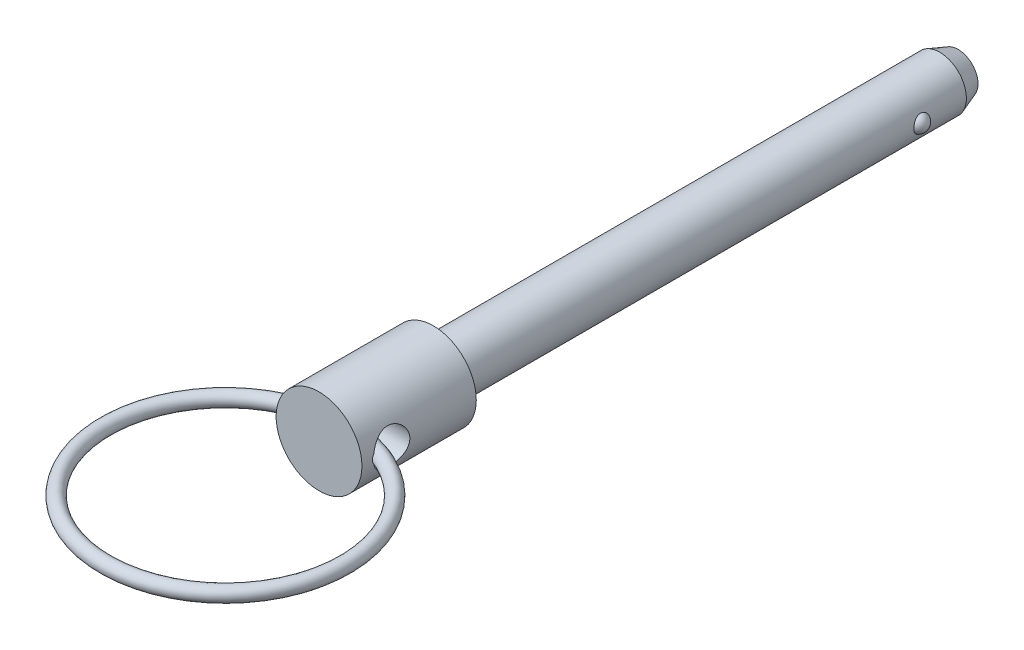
ISO-10303-21;
HEADER;
FILE_DESCRIPTION(('STEP AP214'),'2;1');
FILE_NAME('part.step','',(''),(''),'','','');
FILE_SCHEMA(('AUTOMOTIVE_DESIGN { 1 0 10303 214 1 1 1 1 }'));
ENDSEC;
DATA;
#1=APPLICATION_CONTEXT('core data for automotive mechanical design processes');
#2=APPLICATION_PROTOCOL_DEFINITION('international standard','automotive_design',2000,#1);
#3=PRODUCT_CONTEXT('',#1,'mechanical');
#4=PRODUCT('Part','Part','',(#3));
#5=PRODUCT_RELATED_PRODUCT_CATEGORY('part','',(#4));
#6=PRODUCT_DEFINITION_FORMATION('','',#4);
#7=PRODUCT_DEFINITION_CONTEXT('part definition',#1,'design');
#8=PRODUCT_DEFINITION('design','',#6,#7);
#9=PRODUCT_DEFINITION_SHAPE('','',#8);
#10=(LENGTH_UNIT() NAMED_UNIT(*) SI_UNIT(.MILLI.,.METRE.));
#11=(NAMED_UNIT(*) PLANE_ANGLE_UNIT() SI_UNIT($,.RADIAN.));
#12=(NAMED_UNIT(*) SI_UNIT($,.STERADIAN.) SOLID_ANGLE_UNIT());
#13=UNCERTAINTY_MEASURE_WITH_UNIT(LENGTH_MEASURE(1.E-05),#10,'distance_accuracy_value','');
#14=(GEOMETRIC_REPRESENTATION_CONTEXT(3) GLOBAL_UNCERTAINTY_ASSIGNED_CONTEXT((#13)) GLOBAL_UNIT_ASSIGNED_CONTEXT((#10,
#11,#12)) REPRESENTATION_CONTEXT('',''));
#15=CARTESIAN_POINT('',(0.,0.,0.));
#16=DIRECTION('',(0.,0.,1.));
#17=DIRECTION('',(1.,0.,0.));
#18=AXIS2_PLACEMENT_3D('',#15,#16,#17);
#19=CARTESIAN_POINT('',(6.35,0.,9.398));
#20=DIRECTION('',(-1.,0.,0.));
#21=DIRECTION('',(0.,0.,-1.));
#22=AXIS2_PLACEMENT_3D('',#19,#20,#21);
#23=CYLINDRICAL_SURFACE('',#22,2.0193);
#24=CARTESIAN_POINT('',(-4.76270000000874,0.498153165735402,11.3548893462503));
#25=CARTESIAN_POINT('',(-4.72833190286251,0.475048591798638,11.3607446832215));
#26=CARTESIAN_POINT('',(-4.69505034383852,0.449919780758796,11.3667299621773));
#27=CARTESIAN_POINT('',(-4.63192457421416,0.394832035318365,11.3785339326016));
#28=CARTESIAN_POINT('',(-4.60213511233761,0.364810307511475,11.3843491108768));
#29=CARTESIAN_POINT('',(-4.55535458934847,0.308281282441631,11.393775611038));
#30=CARTESIAN_POINT('',(-4.53705372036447,0.282907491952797,11.3975656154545));
#31=CARTESIAN_POINT('',(-4.50470768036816,0.229597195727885,11.4043835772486));
#32=CARTESIAN_POINT('',(-4.49064226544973,0.201673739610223,11.4074151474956));
#33=CARTESIAN_POINT('',(-4.46975490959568,0.148629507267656,11.4119668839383));
#34=CARTESIAN_POINT('',(-4.46210314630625,0.12385291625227,11.413657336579));
#35=CARTESIAN_POINT('',(-4.45097170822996,0.0733134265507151,11.4161269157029));
#36=CARTESIAN_POINT('',(-4.4474922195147,0.0475504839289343,11.4169060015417));
#37=CARTESIAN_POINT('',(-4.44500621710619,-0.00425946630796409,11.4174619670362));
#38=CARTESIAN_POINT('',(-4.44600914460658,-0.0303069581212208,11.4172367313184));
#39=CARTESIAN_POINT('',(-4.45241947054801,-0.081820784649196,11.4158064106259));
#40=CARTESIAN_POINT('',(-4.45782777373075,-0.107286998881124,11.414601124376));
#41=CARTESIAN_POINT('',(-4.47240849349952,-0.1562944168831,11.4113883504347));
#42=CARTESIAN_POINT('',(-4.48147591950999,-0.179868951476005,11.4094032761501));
#43=CARTESIAN_POINT('',(-4.50279050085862,-0.225454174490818,11.404805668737));
#44=CARTESIAN_POINT('',(-4.51503925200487,-0.247464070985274,11.4021928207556));
#45=CARTESIAN_POINT('',(-4.55011891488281,-0.302206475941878,11.394845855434));
#46=CARTESIAN_POINT('',(-4.57493397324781,-0.333621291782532,11.3897686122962));
#47=CARTESIAN_POINT('',(-4.62912866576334,-0.392111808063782,11.3790894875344));
#48=CARTESIAN_POINT('',(-4.65852008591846,-0.419175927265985,11.3734862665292));
#49=CARTESIAN_POINT('',(-4.71307862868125,-0.463335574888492,11.3635175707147));
#50=CARTESIAN_POINT('',(-4.73757440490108,-0.481267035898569,11.3591766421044));
#51=CARTESIAN_POINT('',(-4.76270000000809,-0.498153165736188,11.3548893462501));
#52=B_SPLINE_CURVE_WITH_KNOTS('',3,(#24,#25,#26,#27,#28,#29,#30,#31,#32,#33,#34,#35,#36,#37,#38,
#39,#40,#41,#42,#43,#44,#45,#46,#47,#48,#49,#50,#51),.UNSPECIFIED.,.F.,.F.,(4,2,2,2,2,2,2,2,2,2,
2,2,2,4),(0.,0.125801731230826,0.253367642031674,0.347579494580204,0.441333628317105,
0.518959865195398,0.596589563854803,0.674382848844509,0.752192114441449,0.827911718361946,
0.903669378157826,1.02403641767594,1.14471874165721,1.2365323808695),.UNSPECIFIED.);
#53=CARTESIAN_POINT('',(-4.73813099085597,0.481166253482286,11.3591352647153));
#54=VERTEX_POINT('',#53);
#55=CARTESIAN_POINT('',(-4.73813099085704,-0.481166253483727,11.359135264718));
#56=VERTEX_POINT('',#55);
#57=EDGE_CURVE('E40',#54,#56,#52,.T.);
#58=ORIENTED_EDGE('',*,*,#57,.F.);
#59=CARTESIAN_POINT('',(-4.7625,0.,11.4173));
#60=CARTESIAN_POINT('',(-4.76249489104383,-0.108112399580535,11.4172937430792));
#61=CARTESIAN_POINT('',(-4.75878025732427,-0.216312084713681,11.408574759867));
#62=CARTESIAN_POINT('',(-4.74429807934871,-0.429541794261,11.3740482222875));
#63=CARTESIAN_POINT('',(-4.73352107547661,-0.534567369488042,11.3482177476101));
#64=CARTESIAN_POINT('',(-4.70606638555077,-0.738151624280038,11.2805979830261));
#65=CARTESIAN_POINT('',(-4.68940628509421,-0.836728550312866,11.2388562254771));
#66=CARTESIAN_POINT('',(-4.65179514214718,-1.02541561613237,11.1408163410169));
#67=CARTESIAN_POINT('',(-4.63084399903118,-1.11552555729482,11.0845178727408));
#68=CARTESIAN_POINT('',(-4.58553515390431,-1.28946876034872,10.9559107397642));
#69=CARTESIAN_POINT('',(-4.56106355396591,-1.37280723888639,10.8829734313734));
#70=CARTESIAN_POINT('',(-4.51195602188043,-1.52649281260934,10.7244940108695));
#71=CARTESIAN_POINT('',(-4.48732001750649,-1.5968337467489,10.6389459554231));
#72=CARTESIAN_POINT('',(-4.43925108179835,-1.7261116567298,10.452343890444));
#73=CARTESIAN_POINT('',(-4.415945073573,-1.78427664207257,10.3507188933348));
#74=CARTESIAN_POINT('',(-4.3749946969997,-1.88246618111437,10.1379969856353));
#75=CARTESIAN_POINT('',(-4.35734737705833,-1.92250019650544,10.026905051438));
#76=CARTESIAN_POINT('',(-4.33095312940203,-1.98122376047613,9.80411364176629));
#77=CARTESIAN_POINT('',(-4.32180970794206,-2.0008697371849,9.69271508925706));
#78=CARTESIAN_POINT('',(-4.31232297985,-2.02124136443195,9.46785625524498));
#79=CARTESIAN_POINT('',(-4.31197457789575,-2.02197796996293,9.35439720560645));
#80=CARTESIAN_POINT('',(-4.31978298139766,-2.00522830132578,9.13832342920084));
#81=CARTESIAN_POINT('',(-4.32726229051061,-1.98919366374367,9.03556669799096));
#82=CARTESIAN_POINT('',(-4.34873498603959,-1.94179810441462,8.83436976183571));
#83=CARTESIAN_POINT('',(-4.36272967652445,-1.91043411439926,8.73593042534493));
#84=CARTESIAN_POINT('',(-4.39597564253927,-1.83265370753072,8.54363008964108));
#85=CARTESIAN_POINT('',(-4.41533413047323,-1.78592620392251,8.44991428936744));
#86=CARTESIAN_POINT('',(-4.45710273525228,-1.67896759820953,8.27128429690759));
#87=CARTESIAN_POINT('',(-4.47951396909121,-1.61873154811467,8.1863733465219));
#88=CARTESIAN_POINT('',(-4.52725353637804,-1.48026834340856,8.0199216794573));
#89=CARTESIAN_POINT('',(-4.55266534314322,-1.40092677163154,7.93932933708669));
#90=CARTESIAN_POINT('',(-4.6018976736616,-1.22958667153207,7.79224755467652));
#91=CARTESIAN_POINT('',(-4.62571737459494,-1.13758167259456,7.72576536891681));
#92=CARTESIAN_POINT('',(-4.66982369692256,-0.940529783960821,7.60732387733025));
#93=CARTESIAN_POINT('',(-4.69000583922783,-0.835212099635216,7.55577397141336));
#94=CARTESIAN_POINT('',(-4.72372878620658,-0.616416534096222,7.47153070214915));
#95=CARTESIAN_POINT('',(-4.7372827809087,-0.502955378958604,7.43879986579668));
#96=CARTESIAN_POINT('',(-4.75192155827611,-0.323662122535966,7.40374908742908));
#97=CARTESIAN_POINT('',(-4.75587275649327,-0.25936366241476,7.39437239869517));
#98=CARTESIAN_POINT('',(-4.76116348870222,-0.130053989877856,7.3818460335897));
#99=CARTESIAN_POINT('',(-4.76250307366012,-0.0650427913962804,7.3786962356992));
#100=CARTESIAN_POINT('',(-4.76249489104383,0.108112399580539,7.37870625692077));
#101=CARTESIAN_POINT('',(-4.75878025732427,0.21631208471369,7.38742524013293));
#102=CARTESIAN_POINT('',(-4.74429807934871,0.429541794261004,7.42195177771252));
#103=CARTESIAN_POINT('',(-4.73352107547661,0.534567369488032,7.44778225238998));
#104=CARTESIAN_POINT('',(-4.70606638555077,0.738151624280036,7.51540201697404));
#105=CARTESIAN_POINT('',(-4.68940628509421,0.836728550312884,7.55714377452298));
#106=CARTESIAN_POINT('',(-4.65179514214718,1.02541561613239,7.65518365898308));
#107=CARTESIAN_POINT('',(-4.63084399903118,1.11552555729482,7.71148212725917));
#108=CARTESIAN_POINT('',(-4.58553515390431,1.28946876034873,7.84008926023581));
#109=CARTESIAN_POINT('',(-4.5610635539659,1.37280723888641,7.91302656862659));
#110=CARTESIAN_POINT('',(-4.51195602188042,1.52649281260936,8.07150598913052));
#111=CARTESIAN_POINT('',(-4.48732001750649,1.59683374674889,8.15705404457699));
#112=CARTESIAN_POINT('',(-4.43925108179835,1.7261116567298,8.34365610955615));
#113=CARTESIAN_POINT('',(-4.41594507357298,1.78427664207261,8.44528110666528));
#114=CARTESIAN_POINT('',(-4.37499469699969,1.88246618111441,8.6580030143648));
#115=CARTESIAN_POINT('',(-4.35734737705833,1.92250019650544,8.76909494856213));
#116=CARTESIAN_POINT('',(-4.33095312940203,1.98122376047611,8.9918863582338));
#117=CARTESIAN_POINT('',(-4.32180970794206,2.00086973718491,9.103284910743));
#118=CARTESIAN_POINT('',(-4.31232297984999,2.02124136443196,9.32814374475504));
#119=CARTESIAN_POINT('',(-4.31197457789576,2.02197796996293,9.44160279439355));
#120=CARTESIAN_POINT('',(-4.31978298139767,2.00522830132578,9.65767657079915));
#121=CARTESIAN_POINT('',(-4.32726229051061,1.98919366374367,9.76043330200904));
#122=CARTESIAN_POINT('',(-4.34873498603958,1.94179810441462,9.96163023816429));
#123=CARTESIAN_POINT('',(-4.36272967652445,1.91043411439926,10.0600695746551));
#124=CARTESIAN_POINT('',(-4.39597564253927,1.83265370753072,10.2523699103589));
#125=CARTESIAN_POINT('',(-4.41533413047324,1.78592620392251,10.3460857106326));
#126=CARTESIAN_POINT('',(-4.45710273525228,1.67896759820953,10.5247157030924));
#127=CARTESIAN_POINT('',(-4.47951396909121,1.61873154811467,10.6096266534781));
#128=CARTESIAN_POINT('',(-4.52725353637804,1.48026834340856,10.7760783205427));
#129=CARTESIAN_POINT('',(-4.55266534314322,1.40092677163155,10.8566706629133));
#130=CARTESIAN_POINT('',(-4.6018976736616,1.22958667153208,11.0037524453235));
#131=CARTESIAN_POINT('',(-4.62571737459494,1.13758167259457,11.0702346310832));
#132=CARTESIAN_POINT('',(-4.66982369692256,0.940529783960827,11.1886761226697));
#133=CARTESIAN_POINT('',(-4.69000583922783,0.835212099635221,11.2402260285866));
#134=CARTESIAN_POINT('',(-4.72372878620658,0.616416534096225,11.3244692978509));
#135=CARTESIAN_POINT('',(-4.7372827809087,0.502955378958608,11.3572001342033));
#136=CARTESIAN_POINT('',(-4.75192155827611,0.32366212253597,11.3922509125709));
#137=CARTESIAN_POINT('',(-4.75587275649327,0.259363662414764,11.4016276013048));
#138=CARTESIAN_POINT('',(-4.76116348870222,0.130053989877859,11.4141539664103));
#139=CARTESIAN_POINT('',(-4.76250307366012,0.0650427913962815,11.4173037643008));
#140=CARTESIAN_POINT('',(-4.7625,0.,11.4173));
#141=B_SPLINE_CURVE_WITH_KNOTS('',3,(#59,#60,#61,#62,#63,#64,#65,#66,#67,#68,#69,#70,#71,#72,
#73,#74,#75,#76,#77,#78,#79,#80,#81,#82,#83,#84,#85,#86,#87,#88,#89,#90,#91,#92,#93,#94,#95,#96,
#97,#98,#99,#100,#101,#102,#103,#104,#105,#106,#107,#108,#109,#110,#111,#112,#113,#114,#115,
#116,#117,#118,#119,#120,#121,#122,#123,#124,#125,#126,#127,#128,#129,#130,#131,#132,#133,#134,
#135,#136,#137,#138,#139,#140),.UNSPECIFIED.,.T.,.F.,(4,2,2,2,2,2,2,2,2,2,2,2,2,2,2,2,2,2,2,2,2,
2,2,2,2,2,2,2,2,2,2,2,2,2,2,2,2,2,2,2,4),(0.,0.324084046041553,0.648603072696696,
0.972160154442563,1.29572482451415,1.63451297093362,1.97346129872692,2.32983137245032,
2.68601525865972,3.02460962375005,3.36300782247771,3.67436181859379,3.98577815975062,
4.30393445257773,4.62220747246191,4.96838833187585,5.31474674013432,5.66985671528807,
6.02425711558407,6.21923699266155,6.41421306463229,6.73829711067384,7.062816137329,
7.38637321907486,7.70993788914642,8.04872603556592,8.38767436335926,8.74404443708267,
9.10022832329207,9.43882268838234,9.77722088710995,10.088574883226,10.3999912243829,
10.71814751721,11.0364205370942,11.3826013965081,11.7289598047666,12.0840697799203,
12.4384701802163,12.6334500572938,12.8284261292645),.UNSPECIFIED.);
#142=EDGE_CURVE('E54',#56,#54,#141,.T.);
#143=ORIENTED_EDGE('',*,*,#142,.F.);
#144=EDGE_LOOP('',(#58,#143));
#145=FACE_BOUND('',#144,.T.);
#146=CARTESIAN_POINT('',(4.76270000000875,-0.498153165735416,11.3548893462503));
#147=CARTESIAN_POINT('',(4.72833190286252,-0.475048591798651,11.3607446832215));
#148=CARTESIAN_POINT('',(4.69505034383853,-0.44991978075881,11.3667299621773));
#149=CARTESIAN_POINT('',(4.63192457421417,-0.394832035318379,11.3785339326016));
#150=CARTESIAN_POINT('',(4.60213511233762,-0.36481030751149,11.3843491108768));
#151=CARTESIAN_POINT('',(4.55535458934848,-0.308281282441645,11.393775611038));
#152=CARTESIAN_POINT('',(4.53705372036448,-0.28290749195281,11.3975656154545));
#153=CARTESIAN_POINT('',(4.50470768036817,-0.229597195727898,11.4043835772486));
#154=CARTESIAN_POINT('',(4.49064226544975,-0.201673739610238,11.4074151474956));
#155=CARTESIAN_POINT('',(4.46975490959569,-0.148629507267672,11.4119668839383));
#156=CARTESIAN_POINT('',(4.46210314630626,-0.123852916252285,11.413657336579));
#157=CARTESIAN_POINT('',(4.45097170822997,-0.0733134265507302,11.4161269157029));
#158=CARTESIAN_POINT('',(4.44749221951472,-0.0475504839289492,11.4169060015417));
#159=CARTESIAN_POINT('',(4.4450062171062,0.00425946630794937,11.4174619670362));
#160=CARTESIAN_POINT('',(4.44600914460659,0.0303069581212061,11.4172367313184));
#161=CARTESIAN_POINT('',(4.45241947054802,0.0818207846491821,11.4158064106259));
#162=CARTESIAN_POINT('',(4.45782777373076,0.107286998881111,11.414601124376));
#163=CARTESIAN_POINT('',(4.47240849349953,0.156294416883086,11.4113883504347));
#164=CARTESIAN_POINT('',(4.48147591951,0.179868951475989,11.4094032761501));
#165=CARTESIAN_POINT('',(4.50279050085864,0.225454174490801,11.404805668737));
#166=CARTESIAN_POINT('',(4.51503925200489,0.247464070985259,11.4021928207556));
#167=CARTESIAN_POINT('',(4.55011891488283,0.302206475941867,11.394845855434));
#168=CARTESIAN_POINT('',(4.57493397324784,0.333621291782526,11.3897686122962));
#169=CARTESIAN_POINT('',(4.62912866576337,0.392111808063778,11.3790894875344));
#170=CARTESIAN_POINT('',(4.6585200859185,0.419175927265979,11.3734862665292));
#171=CARTESIAN_POINT('',(4.71307862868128,0.463335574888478,11.3635175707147));
#172=CARTESIAN_POINT('',(4.7375744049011,0.481267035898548,11.3591766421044));
#173=CARTESIAN_POINT('',(4.76270000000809,0.498153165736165,11.3548893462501));
#174=B_SPLINE_CURVE_WITH_KNOTS('',3,(#146,#147,#148,#149,#150,#151,#152,#153,#154,#155,#156,
#157,#158,#159,#160,#161,#162,#163,#164,#165,#166,#167,#168,#169,#170,#171,#172,#173),
.UNSPECIFIED.,.F.,.F.,(4,2,2,2,2,2,2,2,2,2,2,2,2,4),(0.,0.125801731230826,0.253367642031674,
0.347579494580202,0.441333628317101,0.518959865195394,0.596589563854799,0.674382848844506,
0.752192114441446,0.827911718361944,0.903669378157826,1.02403641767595,1.14471874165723,
1.23653238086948),.UNSPECIFIED.);
#175=CARTESIAN_POINT('',(4.73813099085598,-0.481166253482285,11.3591352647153));
#176=VERTEX_POINT('',#175);
#177=CARTESIAN_POINT('',(4.73813099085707,0.481166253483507,11.359135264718));
#178=VERTEX_POINT('',#177);
#179=EDGE_CURVE('E33',#176,#178,#174,.T.);
#180=ORIENTED_EDGE('',*,*,#179,.F.);
#181=CARTESIAN_POINT('',(4.7625,0.,7.3787));
#182=CARTESIAN_POINT('',(4.76249489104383,-0.108112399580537,7.37870625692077));
#183=CARTESIAN_POINT('',(4.75878025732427,-0.216312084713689,7.38742524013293));
#184=CARTESIAN_POINT('',(4.74429807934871,-0.429541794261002,7.42195177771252));
#185=CARTESIAN_POINT('',(4.73352107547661,-0.534567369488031,7.44778225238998));
#186=CARTESIAN_POINT('',(4.70606638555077,-0.738151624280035,7.51540201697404));
#187=CARTESIAN_POINT('',(4.6894062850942,-0.836728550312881,7.55714377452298));
#188=CARTESIAN_POINT('',(4.65179514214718,-1.02541561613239,7.65518365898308));
#189=CARTESIAN_POINT('',(4.63084399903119,-1.11552555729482,7.71148212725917));
#190=CARTESIAN_POINT('',(4.58553515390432,-1.28946876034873,7.84008926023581));
#191=CARTESIAN_POINT('',(4.5610635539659,-1.37280723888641,7.91302656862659));
#192=CARTESIAN_POINT('',(4.51195602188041,-1.52649281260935,8.07150598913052));
#193=CARTESIAN_POINT('',(4.48732001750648,-1.59683374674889,8.15705404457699));
#194=CARTESIAN_POINT('',(4.43925108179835,-1.7261116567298,8.34365610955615));
#195=CARTESIAN_POINT('',(4.41594507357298,-1.7842766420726,8.44528110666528));
#196=CARTESIAN_POINT('',(4.37499469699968,-1.88246618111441,8.6580030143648));
#197=CARTESIAN_POINT('',(4.35734737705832,-1.92250019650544,8.76909494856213));
#198=CARTESIAN_POINT('',(4.33095312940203,-1.98122376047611,8.9918863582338));
#199=CARTESIAN_POINT('',(4.32180970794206,-2.0008697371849,9.103284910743));
#200=CARTESIAN_POINT('',(4.31232297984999,-2.02124136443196,9.32814374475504));
#201=CARTESIAN_POINT('',(4.31197457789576,-2.02197796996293,9.44160279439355));
#202=CARTESIAN_POINT('',(4.31978298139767,-2.00522830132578,9.65767657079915));
#203=CARTESIAN_POINT('',(4.32726229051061,-1.98919366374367,9.76043330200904));
#204=CARTESIAN_POINT('',(4.34873498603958,-1.94179810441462,9.96163023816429));
#205=CARTESIAN_POINT('',(4.36272967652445,-1.91043411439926,10.0600695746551));
#206=CARTESIAN_POINT('',(4.39597564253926,-1.83265370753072,10.2523699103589));
#207=CARTESIAN_POINT('',(4.41533413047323,-1.78592620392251,10.3460857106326));
#208=CARTESIAN_POINT('',(4.45710273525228,-1.67896759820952,10.5247157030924));
#209=CARTESIAN_POINT('',(4.47951396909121,-1.61873154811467,10.6096266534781));
#210=CARTESIAN_POINT('',(4.52725353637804,-1.48026834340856,10.7760783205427));
#211=CARTESIAN_POINT('',(4.55266534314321,-1.40092677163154,10.8566706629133));
#212=CARTESIAN_POINT('',(4.60189767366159,-1.22958667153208,11.0037524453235));
#213=CARTESIAN_POINT('',(4.62571737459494,-1.13758167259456,11.0702346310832));
#214=CARTESIAN_POINT('',(4.66982369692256,-0.940529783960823,11.1886761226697));
#215=CARTESIAN_POINT('',(4.69000583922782,-0.835212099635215,11.2402260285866));
#216=CARTESIAN_POINT('',(4.72372878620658,-0.61641653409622,11.3244692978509));
#217=CARTESIAN_POINT('',(4.73728278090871,-0.502955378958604,11.3572001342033));
#218=CARTESIAN_POINT('',(4.75192155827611,-0.323662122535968,11.3922509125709));
#219=CARTESIAN_POINT('',(4.75587275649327,-0.259363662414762,11.4016276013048));
#220=CARTESIAN_POINT('',(4.76116348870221,-0.130053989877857,11.4141539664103));
#221=CARTESIAN_POINT('',(4.76250307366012,-0.0650427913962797,11.4173037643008));
#222=CARTESIAN_POINT('',(4.76249489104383,0.108112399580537,11.4172937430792));
#223=CARTESIAN_POINT('',(4.75878025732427,0.216312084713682,11.408574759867));
#224=CARTESIAN_POINT('',(4.74429807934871,0.429541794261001,11.3740482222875));
#225=CARTESIAN_POINT('',(4.73352107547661,0.534567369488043,11.3482177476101));
#226=CARTESIAN_POINT('',(4.70606638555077,0.738151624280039,11.2805979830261));
#227=CARTESIAN_POINT('',(4.68940628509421,0.836728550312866,11.2388562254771));
#228=CARTESIAN_POINT('',(4.65179514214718,1.02541561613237,11.1408163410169));
#229=CARTESIAN_POINT('',(4.63084399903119,1.11552555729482,11.0845178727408));
#230=CARTESIAN_POINT('',(4.58553515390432,1.28946876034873,10.9559107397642));
#231=CARTESIAN_POINT('',(4.56106355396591,1.37280723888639,10.8829734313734));
#232=CARTESIAN_POINT('',(4.51195602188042,1.52649281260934,10.7244940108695));
#233=CARTESIAN_POINT('',(4.48732001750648,1.5968337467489,10.6389459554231));
#234=CARTESIAN_POINT('',(4.43925108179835,1.7261116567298,10.452343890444));
#235=CARTESIAN_POINT('',(4.41594507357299,1.78427664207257,10.3507188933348));
#236=CARTESIAN_POINT('',(4.3749946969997,1.88246618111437,10.1379969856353));
#237=CARTESIAN_POINT('',(4.35734737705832,1.92250019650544,10.026905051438));
#238=CARTESIAN_POINT('',(4.33095312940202,1.98122376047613,9.80411364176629));
#239=CARTESIAN_POINT('',(4.32180970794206,2.00086973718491,9.69271508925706));
#240=CARTESIAN_POINT('',(4.31232297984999,2.02124136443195,9.46785625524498));
#241=CARTESIAN_POINT('',(4.31197457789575,2.02197796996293,9.35439720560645));
#242=CARTESIAN_POINT('',(4.31978298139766,2.00522830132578,9.13832342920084));
#243=CARTESIAN_POINT('',(4.32726229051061,1.98919366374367,9.03556669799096));
#244=CARTESIAN_POINT('',(4.34873498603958,1.94179810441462,8.83436976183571));
#245=CARTESIAN_POINT('',(4.36272967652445,1.91043411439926,8.73593042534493));
#246=CARTESIAN_POINT('',(4.39597564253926,1.83265370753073,8.54363008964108));
#247=CARTESIAN_POINT('',(4.41533413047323,1.78592620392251,8.44991428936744));
#248=CARTESIAN_POINT('',(4.45710273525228,1.67896759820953,8.27128429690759));
#249=CARTESIAN_POINT('',(4.47951396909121,1.61873154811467,8.1863733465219));
#250=CARTESIAN_POINT('',(4.52725353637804,1.48026834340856,8.0199216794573));
#251=CARTESIAN_POINT('',(4.55266534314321,1.40092677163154,7.93932933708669));
#252=CARTESIAN_POINT('',(4.60189767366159,1.22958667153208,7.79224755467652));
#253=CARTESIAN_POINT('',(4.62571737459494,1.13758167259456,7.72576536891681));
#254=CARTESIAN_POINT('',(4.66982369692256,0.940529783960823,7.60732387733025));
#255=CARTESIAN_POINT('',(4.69000583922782,0.835212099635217,7.55577397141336));
#256=CARTESIAN_POINT('',(4.72372878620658,0.616416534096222,7.47153070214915));
#257=CARTESIAN_POINT('',(4.73728278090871,0.502955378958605,7.43879986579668));
#258=CARTESIAN_POINT('',(4.75192155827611,0.323662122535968,7.40374908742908));
#259=CARTESIAN_POINT('',(4.75587275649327,0.259363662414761,7.39437239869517));
#260=CARTESIAN_POINT('',(4.76116348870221,0.130053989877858,7.3818460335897));
#261=CARTESIAN_POINT('',(4.76250307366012,0.0650427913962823,7.3786962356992));
#262=CARTESIAN_POINT('',(4.7625,0.,7.3787));
#263=B_SPLINE_CURVE_WITH_KNOTS('',3,(#181,#182,#183,#184,#185,#186,#187,#188,#189,#190,#191,
#192,#193,#194,#195,#196,#197,#198,#199,#200,#201,#202,#203,#204,#205,#206,#207,#208,#209,#210,
#211,#212,#213,#214,#215,#216,#217,#218,#219,#220,#221,#222,#223,#224,#225,#226,#227,#228,#229,
#230,#231,#232,#233,#234,#235,#236,#237,#238,#239,#240,#241,#242,#243,#244,#245,#246,#247,#248,
#249,#250,#251,#252,#253,#254,#255,#256,#257,#258,#259,#260,#261,#262),.UNSPECIFIED.,.T.,.F.,(4,
2,2,2,2,2,2,2,2,2,2,2,2,2,2,2,2,2,2,2,2,2,2,2,2,2,2,2,2,2,2,2,2,2,2,2,2,2,2,2,4),(0.,
0.324084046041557,0.648603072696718,0.972160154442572,1.29572482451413,1.63451297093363,
1.97346129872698,2.32983137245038,2.68601525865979,3.02460962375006,3.36300782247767,
3.67436181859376,3.98577815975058,4.3039344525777,4.62220747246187,4.96838833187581,
5.31474674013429,5.66985671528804,6.02425711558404,6.21923699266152,6.41421306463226,
6.73829711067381,7.06281613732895,7.38637321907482,7.7099378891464,8.04872603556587,
8.38767436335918,8.74404443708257,9.10022832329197,9.43882268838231,9.77722088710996,
10.088574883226,10.3999912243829,10.71814751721,11.0364205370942,11.3826013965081,
11.7289598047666,12.0840697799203,12.4384701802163,12.6334500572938,12.8284261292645),.UNSPECIFIED.);
#264=EDGE_CURVE('E50',#178,#176,#263,.T.);
#265=ORIENTED_EDGE('',*,*,#264,.F.);
#266=EDGE_LOOP('',(#180,#265));
#267=FACE_BOUND('',#266,.T.);
#268=ADVANCED_FACE('F14',(#145,#267),#23,.F.);
#269=CARTESIAN_POINT('',(0.,0.,-23.2664));
#270=DIRECTION('',(0.,0.,-1.));
#271=DIRECTION('',(1.,0.,0.));
#272=AXIS2_PLACEMENT_3D('',#269,#270,#271);
#273=CYLINDRICAL_SURFACE('',#272,4.7625);
#274=ORIENTED_EDGE('',*,*,#264,.T.);
#275=CARTESIAN_POINT('',(4.75672783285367,-0.234410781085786,9.8638909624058));
#276=CARTESIAN_POINT('',(4.75463715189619,-0.276823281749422,9.87695364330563));
#277=CARTESIAN_POINT('',(4.75202741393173,-0.318142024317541,9.89358560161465));
#278=CARTESIAN_POINT('',(4.74605906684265,-0.397384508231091,9.93354154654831));
#279=CARTESIAN_POINT('',(4.74269965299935,-0.435304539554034,9.95687273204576));
#280=CARTESIAN_POINT('',(4.7356117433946,-0.506628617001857,10.0095466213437));
#281=CARTESIAN_POINT('',(4.731883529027,-0.540036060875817,10.0388847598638));
#282=CARTESIAN_POINT('',(4.7244690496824,-0.601463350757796,10.1027270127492));
#283=CARTESIAN_POINT('',(4.7207827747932,-0.629484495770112,10.1372298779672));
#284=CARTESIAN_POINT('',(4.71381973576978,-0.679675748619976,10.2106969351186));
#285=CARTESIAN_POINT('',(4.71054647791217,-0.701797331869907,10.2496945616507));
#286=CARTESIAN_POINT('',(4.70478201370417,-0.739457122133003,10.3307970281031));
#287=CARTESIAN_POINT('',(4.70229092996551,-0.754994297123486,10.3729023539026));
#288=CARTESIAN_POINT('',(4.69825743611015,-0.779709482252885,10.4605198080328));
#289=CARTESIAN_POINT('',(4.69674995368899,-0.788654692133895,10.5060989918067));
#290=CARTESIAN_POINT('',(4.694941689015,-0.799348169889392,10.5981124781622));
#291=CARTESIAN_POINT('',(4.69464124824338,-0.801094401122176,10.6445470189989));
#292=CARTESIAN_POINT('',(4.6952559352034,-0.797484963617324,10.7400273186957));
#293=CARTESIAN_POINT('',(4.6962479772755,-0.791679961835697,10.7890554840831));
#294=CARTESIAN_POINT('',(4.69943436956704,-0.772538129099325,10.88558205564));
#295=CARTESIAN_POINT('',(4.70162918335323,-0.759198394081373,10.9330798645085));
#296=CARTESIAN_POINT('',(4.7071366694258,-0.724294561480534,11.0283694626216));
#297=CARTESIAN_POINT('',(4.71051187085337,-0.702258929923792,11.0759856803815));
#298=CARTESIAN_POINT('',(4.71792781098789,-0.650571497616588,11.1668661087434));
#299=CARTESIAN_POINT('',(4.72196879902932,-0.620916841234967,11.2101286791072));
#300=CARTESIAN_POINT('',(4.73024120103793,-0.554392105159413,11.2909794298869));
#301=CARTESIAN_POINT('',(4.73447324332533,-0.517496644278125,11.3285468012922));
#302=CARTESIAN_POINT('',(4.74255290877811,-0.437280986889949,11.3961281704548));
#303=CARTESIAN_POINT('',(4.74640083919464,-0.393965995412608,11.4261482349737));
#304=CARTESIAN_POINT('',(4.75279848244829,-0.306647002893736,11.474317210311));
#305=CARTESIAN_POINT('',(4.7554392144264,-0.263139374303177,11.4933494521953));
#306=CARTESIAN_POINT('',(4.75956072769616,-0.173210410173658,11.5225838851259));
#307=CARTESIAN_POINT('',(4.76104300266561,-0.126792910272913,11.5327974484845));
#308=CARTESIAN_POINT('',(4.7625121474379,-0.039222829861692,11.5429046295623));
#309=CARTESIAN_POINT('',(4.76267454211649,0.00179015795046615,11.5440098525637));
#310=CARTESIAN_POINT('',(4.76194485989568,0.0833582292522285,11.5390051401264));
#311=CARTESIAN_POINT('',(4.76105302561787,0.123913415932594,11.5328968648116));
#312=CARTESIAN_POINT('',(4.75839052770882,0.201390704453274,11.5143023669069));
#313=CARTESIAN_POINT('',(4.75666474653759,0.238393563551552,11.5021410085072));
#314=CARTESIAN_POINT('',(4.75253498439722,0.31000909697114,11.4722173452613));
#315=CARTESIAN_POINT('',(4.75013086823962,0.344621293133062,11.4544539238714));
#316=CARTESIAN_POINT('',(4.74468244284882,0.413106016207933,11.4126354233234));
#317=CARTESIAN_POINT('',(4.74160529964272,0.446760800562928,11.3882294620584));
#318=CARTESIAN_POINT('',(4.73521429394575,0.510064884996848,11.3347169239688));
#319=CARTESIAN_POINT('',(4.73190032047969,0.539712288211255,11.3056081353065));
#320=CARTESIAN_POINT('',(4.72489226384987,0.598141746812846,11.2395451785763));
#321=CARTESIAN_POINT('',(4.72120374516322,0.626328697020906,11.2020637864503));
#322=CARTESIAN_POINT('',(4.71424234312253,0.676737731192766,11.1232450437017));
#323=CARTESIAN_POINT('',(4.71096968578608,0.698956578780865,11.0819056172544));
#324=CARTESIAN_POINT('',(4.70485086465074,0.739081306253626,10.9918449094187));
#325=CARTESIAN_POINT('',(4.70208579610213,0.756287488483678,10.9428045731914));
#326=CARTESIAN_POINT('',(4.69779376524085,0.78250724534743,10.8425158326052));
#327=CARTESIAN_POINT('',(4.69626707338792,0.791519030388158,10.7912669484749));
#328=CARTESIAN_POINT('',(4.69466144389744,0.800990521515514,10.6869325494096));
#329=CARTESIAN_POINT('',(4.69461132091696,0.801280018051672,10.6338307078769));
#330=CARTESIAN_POINT('',(4.69610058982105,0.792506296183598,10.5284214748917));
#331=CARTESIAN_POINT('',(4.69763938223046,0.783446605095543,10.4761137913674));
#332=CARTESIAN_POINT('',(4.70202301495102,0.756674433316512,10.3770218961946));
#333=CARTESIAN_POINT('',(4.70478816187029,0.739486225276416,10.3300928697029));
#334=CARTESIAN_POINT('',(4.71127399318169,0.696967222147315,10.2401511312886));
#335=CARTESIAN_POINT('',(4.7149942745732,0.671639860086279,10.1971367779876));
#336=CARTESIAN_POINT('',(4.72264431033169,0.615452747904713,10.1192841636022));
#337=CARTESIAN_POINT('',(4.72654308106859,0.585080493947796,10.0840903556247));
#338=CARTESIAN_POINT('',(4.73429341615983,0.518639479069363,10.0195645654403));
#339=CARTESIAN_POINT('',(4.73814499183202,0.482572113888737,9.99023115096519));
#340=CARTESIAN_POINT('',(4.74520575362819,0.407195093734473,9.93927752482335));
#341=CARTESIAN_POINT('',(4.74843306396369,0.368048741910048,9.9174178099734));
#342=CARTESIAN_POINT('',(4.75404590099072,0.286564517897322,9.88060848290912));
#343=CARTESIAN_POINT('',(4.75643129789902,0.244226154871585,9.86565993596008));
#344=CARTESIAN_POINT('',(4.76007108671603,0.158026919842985,9.84320151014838));
#345=CARTESIAN_POINT('',(4.7613364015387,0.114185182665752,9.83561971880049));
#346=CARTESIAN_POINT('',(4.76263391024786,0.0258666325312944,9.82784590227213));
#347=CARTESIAN_POINT('',(4.76266746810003,-0.018609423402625,9.82764570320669));
#348=CARTESIAN_POINT('',(4.76170334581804,-0.09187243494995,9.83342133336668));
#349=CARTESIAN_POINT('',(4.76105293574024,-0.120844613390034,9.83731729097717));
#350=CARTESIAN_POINT('',(4.75925240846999,-0.178172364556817,9.84825826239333));
#351=CARTESIAN_POINT('',(4.75810228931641,-0.20652793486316,9.85530328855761));
#352=CARTESIAN_POINT('',(4.75672783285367,-0.234410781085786,9.8638909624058));
#353=B_SPLINE_CURVE_WITH_KNOTS('',3,(#275,#276,#277,#278,#279,#280,#281,#282,#283,#284,#285,
#286,#287,#288,#289,#290,#291,#292,#293,#294,#295,#296,#297,#298,#299,#300,#301,#302,#303,#304,
#305,#306,#307,#308,#309,#310,#311,#312,#313,#314,#315,#316,#317,#318,#319,#320,#321,#322,#323,
#324,#325,#326,#327,#328,#329,#330,#331,#332,#333,#334,#335,#336,#337,#338,#339,#340,#341,#342,
#343,#344,#345,#346,#347,#348,#349,#350,#351,#352),.UNSPECIFIED.,.T.,.F.,(4,2,2,2,2,2,2,2,2,2,2,
2,2,2,2,2,2,2,2,2,2,2,2,2,2,2,2,2,2,2,2,2,2,2,2,2,2,2,4),(0.,0.133176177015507,0.26649600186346,
0.399714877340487,0.532901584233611,0.667152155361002,0.80142376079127,0.940235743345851,
1.07908699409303,1.22659070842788,1.37415131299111,1.53115159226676,1.68821080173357,
1.8458307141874,2.0033235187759,2.1451629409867,2.28681917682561,2.40926643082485,
2.53168551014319,2.64814679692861,2.76463131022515,2.88919364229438,3.01381473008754,
3.15436663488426,3.29499460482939,3.45041783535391,3.60587500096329,3.76436388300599,
3.92279299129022,4.07216500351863,4.2214740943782,4.36072714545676,4.49994612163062,
4.63415709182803,4.76838874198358,4.90129648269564,5.03405704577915,5.12160944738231,
5.20916219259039),.UNSPECIFIED.);
#354=EDGE_CURVE('E27',#176,#178,#353,.T.);
#355=ORIENTED_EDGE('',*,*,#354,.T.);
#356=EDGE_LOOP('',(#274,#355));
#357=FACE_BOUND('',#356,.T.);
#358=CARTESIAN_POINT('',(0.,0.,1.14006026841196E-11));
#359=DIRECTION('',(0.,0.,-1.));
#360=DIRECTION('',(1.,0.,0.));
#361=AXIS2_PLACEMENT_3D('',#358,#359,#360);
#362=CIRCLE('',#361,4.76249999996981);
#363=CARTESIAN_POINT('',(4.76249999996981,0.,1.14003927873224E-11));
#364=VERTEX_POINT('',#363);
#365=EDGE_CURVE('E59',#364,#364,#362,.T.);
#366=ORIENTED_EDGE('',*,*,#365,.F.);
#367=EDGE_LOOP('',(#366));
#368=FACE_BOUND('',#367,.T.);
#369=CARTESIAN_POINT('',(0.,0.,12.7000000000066));
#370=DIRECTION('',(0.,0.,-1.));
#371=DIRECTION('',(1.,0.,0.));
#372=AXIS2_PLACEMENT_3D('',#369,#370,#371);
#373=CIRCLE('',#372,4.76249999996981);
#374=CARTESIAN_POINT('',(4.76249999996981,0.,12.7000000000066));
#375=VERTEX_POINT('',#374);
#376=EDGE_CURVE('E135',#375,#375,#373,.T.);
#377=ORIENTED_EDGE('',*,*,#376,.T.);
#378=EDGE_LOOP('',(#377));
#379=FACE_BOUND('',#378,.T.);
#380=ORIENTED_EDGE('',*,*,#142,.T.);
#381=CARTESIAN_POINT('',(-4.75672783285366,-0.234410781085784,9.8638909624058));
#382=CARTESIAN_POINT('',(-4.75880797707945,-0.192184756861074,9.85088943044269));
#383=CARTESIAN_POINT('',(-4.76037619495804,-0.148820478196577,9.84140883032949));
#384=CARTESIAN_POINT('',(-4.76231114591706,-0.0610623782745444,9.82976057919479));
#385=CARTESIAN_POINT('',(-4.76267662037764,-0.0166675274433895,9.82760058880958));
#386=CARTESIAN_POINT('',(-4.76216356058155,0.0718447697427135,9.83066350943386));
#387=CARTESIAN_POINT('',(-4.76128553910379,0.115962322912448,9.83588337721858));
#388=CARTESIAN_POINT('',(-4.75838343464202,0.202671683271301,9.85356395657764));
#389=CARTESIAN_POINT('',(-4.75635960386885,0.245263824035,9.86602307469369));
#390=CARTESIAN_POINT('',(-4.75138989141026,0.327732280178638,9.89785096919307));
#391=CARTESIAN_POINT('',(-4.74844388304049,0.367608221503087,9.91722069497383));
#392=CARTESIAN_POINT('',(-4.74195662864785,0.443516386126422,9.96233891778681));
#393=CARTESIAN_POINT('',(-4.73841538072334,0.479548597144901,9.98808743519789));
#394=CARTESIAN_POINT('',(-4.73111995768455,0.546865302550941,10.0453065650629));
#395=CARTESIAN_POINT('',(-4.72736528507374,0.578138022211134,10.0767909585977));
#396=CARTESIAN_POINT('',(-4.72006096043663,0.635024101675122,10.1445276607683));
#397=CARTESIAN_POINT('',(-4.71651131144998,0.660637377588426,10.1807800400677));
#398=CARTESIAN_POINT('',(-4.70994476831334,0.705946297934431,10.2575433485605));
#399=CARTESIAN_POINT('',(-4.70693606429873,0.725553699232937,10.2981069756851));
#400=CARTESIAN_POINT('',(-4.70181675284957,0.758021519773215,10.3818966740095));
#401=CARTESIAN_POINT('',(-4.69970628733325,0.770880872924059,10.4251231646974));
#402=CARTESIAN_POINT('',(-4.69650867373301,0.79013471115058,10.5148288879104));
#403=CARTESIAN_POINT('',(-4.69546563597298,0.796251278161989,10.5613691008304));
#404=CARTESIAN_POINT('',(-4.69462220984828,0.801207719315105,10.6548424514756));
#405=CARTESIAN_POINT('',(-4.69482220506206,0.800045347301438,10.7017757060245));
#406=CARTESIAN_POINT('',(-4.69645733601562,0.790392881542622,10.7979976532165));
#407=CARTESIAN_POINT('',(-4.69797327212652,0.781423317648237,10.8472368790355));
#408=CARTESIAN_POINT('',(-4.70214662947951,0.755902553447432,10.943667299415));
#409=CARTESIAN_POINT('',(-4.70480451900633,0.739348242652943,10.9908576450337));
#410=CARTESIAN_POINT('',(-4.71113533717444,0.697907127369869,11.0846488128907));
#411=CARTESIAN_POINT('',(-4.71485784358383,0.672595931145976,11.1310597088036));
#412=CARTESIAN_POINT('',(-4.72278864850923,0.614436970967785,11.2188860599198));
#413=CARTESIAN_POINT('',(-4.72699707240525,0.581587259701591,11.2603002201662));
#414=CARTESIAN_POINT('',(-4.73530162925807,0.509526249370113,11.3359421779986));
#415=CARTESIAN_POINT('',(-4.73939847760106,0.470426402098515,11.3702753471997));
#416=CARTESIAN_POINT('',(-4.74699023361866,0.386343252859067,11.4308675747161));
#417=CARTESIAN_POINT('',(-4.75048579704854,0.341366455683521,11.4571354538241));
#418=CARTESIAN_POINT('',(-4.75599223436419,0.252376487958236,11.4974010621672));
#419=CARTESIAN_POINT('',(-4.75812829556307,0.208856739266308,11.5124686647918));
#420=CARTESIAN_POINT('',(-4.76120337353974,0.119700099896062,11.5339491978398));
#421=CARTESIAN_POINT('',(-4.76214369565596,0.0740655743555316,11.540371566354));
#422=CARTESIAN_POINT('',(-4.76265411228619,-0.0117455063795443,11.54386707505));
#423=CARTESIAN_POINT('',(-4.76238280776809,-0.0518805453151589,11.5420222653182));
#424=CARTESIAN_POINT('',(-4.76085712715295,-0.131220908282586,11.531508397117));
#425=CARTESIAN_POINT('',(-4.75960284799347,-0.170426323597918,11.5228400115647));
#426=CARTESIAN_POINT('',(-4.75629335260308,-0.245921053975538,11.499439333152));
#427=CARTESIAN_POINT('',(-4.75425749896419,-0.282257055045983,11.4848531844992));
#428=CARTESIAN_POINT('',(-4.74958711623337,-0.352221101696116,11.4503009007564));
#429=CARTESIAN_POINT('',(-4.74695243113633,-0.385848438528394,11.4303333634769));
#430=CARTESIAN_POINT('',(-4.74107206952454,-0.452616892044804,11.3838151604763));
#431=CARTESIAN_POINT('',(-4.73779315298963,-0.485460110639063,11.3568423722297));
#432=CARTESIAN_POINT('',(-4.73110830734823,-0.546785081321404,11.2983457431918));
#433=CARTESIAN_POINT('',(-4.72770231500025,-0.575264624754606,11.2668196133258));
#434=CARTESIAN_POINT('',(-4.72061927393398,-0.630909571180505,11.1957249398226));
#435=CARTESIAN_POINT('',(-4.71696449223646,-0.657423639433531,11.1556436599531));
#436=CARTESIAN_POINT('',(-4.7102323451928,-0.704040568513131,11.071860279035));
#437=CARTESIAN_POINT('',(-4.70715528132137,-0.724140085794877,11.0281563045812));
#438=CARTESIAN_POINT('',(-4.7016537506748,-0.759079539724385,10.9340419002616));
#439=CARTESIAN_POINT('',(-4.69931471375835,-0.773270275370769,10.8833836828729));
#440=CARTESIAN_POINT('',(-4.69601325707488,-0.793074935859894,10.7803615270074));
#441=CARTESIAN_POINT('',(-4.69505096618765,-0.798688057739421,10.7279974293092));
#442=CARTESIAN_POINT('',(-4.69467378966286,-0.800903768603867,10.6230225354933));
#443=CARTESIAN_POINT('',(-4.69525980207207,-0.797501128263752,10.5704116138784));
#444=CARTESIAN_POINT('',(-4.69796643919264,-0.781399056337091,10.4666696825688));
#445=CARTESIAN_POINT('',(-4.70008633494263,-0.768704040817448,10.4155379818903));
#446=CARTESIAN_POINT('',(-4.70543825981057,-0.735202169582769,10.3197920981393));
#447=CARTESIAN_POINT('',(-4.70858907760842,-0.714975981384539,10.2749703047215));
#448=CARTESIAN_POINT('',(-4.71564813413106,-0.666826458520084,10.189721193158));
#449=CARTESIAN_POINT('',(-4.71955625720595,-0.638904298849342,10.1492932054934));
#450=CARTESIAN_POINT('',(-4.72737726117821,-0.578090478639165,10.0766022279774));
#451=CARTESIAN_POINT('',(-4.73127475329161,-0.545615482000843,10.0439879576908));
#452=CARTESIAN_POINT('',(-4.73883375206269,-0.475496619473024,9.98491901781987));
#453=CARTESIAN_POINT('',(-4.74249555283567,-0.437859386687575,9.95845655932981));
#454=CARTESIAN_POINT('',(-4.74798881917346,-0.37240054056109,9.9204962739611));
#455=CARTESIAN_POINT('',(-4.75001326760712,-0.345732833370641,9.90699794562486));
#456=CARTESIAN_POINT('',(-4.7536791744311,-0.291020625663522,9.88309301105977));
#457=CARTESIAN_POINT('',(-4.75532064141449,-0.262976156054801,9.87268633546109));
#458=CARTESIAN_POINT('',(-4.75672783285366,-0.234410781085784,9.8638909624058));
#459=B_SPLINE_CURVE_WITH_KNOTS('',3,(#381,#382,#383,#384,#385,#386,#387,#388,#389,#390,#391,
#392,#393,#394,#395,#396,#397,#398,#399,#400,#401,#402,#403,#404,#405,#406,#407,#408,#409,#410,
#411,#412,#413,#414,#415,#416,#417,#418,#419,#420,#421,#422,#423,#424,#425,#426,#427,#428,#429,
#430,#431,#432,#433,#434,#435,#436,#437,#438,#439,#440,#441,#442,#443,#444,#445,#446,#447,#448,
#449,#450,#451,#452,#453,#454,#455,#456,#457,#458),.UNSPECIFIED.,.T.,.F.,(4,2,2,2,2,2,2,2,2,2,2,
2,2,2,2,2,2,2,2,2,2,2,2,2,2,2,2,2,2,2,2,2,2,2,2,2,2,2,4),(0.,0.132584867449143,
0.265308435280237,0.397977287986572,0.53061694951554,0.66327484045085,0.795933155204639,
0.928914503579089,1.0618978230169,1.19675044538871,1.3316243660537,1.47187070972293,
1.61216033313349,1.76172674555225,1.91135454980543,2.06958609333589,2.22785855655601,
2.38357184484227,2.53911422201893,2.67661376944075,2.81396308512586,2.93389956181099,
3.05382421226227,3.17095185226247,3.2881100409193,3.41548078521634,3.54291578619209,
3.68690552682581,3.83097019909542,3.98821148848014,4.1454674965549,4.30281473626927,
4.46008724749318,4.60714088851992,4.75417209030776,4.89206605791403,5.02978447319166,
5.11947848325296,5.20917048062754),.UNSPECIFIED.);
#460=EDGE_CURVE('E9',#54,#56,#459,.T.);
#461=ORIENTED_EDGE('',*,*,#460,.T.);
#462=EDGE_LOOP('',(#380,#461));
#463=FACE_BOUND('',#462,.T.);
#464=ADVANCED_FACE('F52',(#357,#368,#379,#463),#273,.T.);
#465=CARTESIAN_POINT('',(0.,0.,-35.));
#466=DIRECTION('',(0.,0.,1.));
#467=DIRECTION('',(-0.810321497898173,-0.585985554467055,0.));
#468=AXIS2_PLACEMENT_3D('',#465,#466,#467);
#469=CYLINDRICAL_SURFACE('',#468,2.95529);
#470=CARTESIAN_POINT('',(0.,0.,0.));
#471=DIRECTION('',(0.,0.,-1.));
#472=DIRECTION('',(0.810321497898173,0.585985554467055,0.));
#473=AXIS2_PLACEMENT_3D('',#470,#471,#472);
#474=CIRCLE('',#473,2.95529);
#475=CARTESIAN_POINT('',(2.3947350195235,1.73175724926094,0.));
#476=VERTEX_POINT('',#475);
#477=EDGE_CURVE('E48',#476,#476,#474,.T.);
#478=ORIENTED_EDGE('',*,*,#477,.T.);
#479=EDGE_LOOP('',(#478));
#480=FACE_BOUND('',#479,.T.);
#481=CARTESIAN_POINT('',(-2.95529,0.,-52.1918269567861));
#482=CARTESIAN_POINT('',(-2.95528983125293,0.0550926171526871,-52.1918267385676));
#483=CARTESIAN_POINT('',(-2.9537360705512,0.110186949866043,-52.1874652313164));
#484=CARTESIAN_POINT('',(-2.94767937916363,0.218829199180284,-52.170085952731));
#485=CARTESIAN_POINT('',(-2.94317634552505,0.272377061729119,-52.1570678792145));
#486=CARTESIAN_POINT('',(-2.93168588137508,0.376429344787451,-52.1225739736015));
#487=CARTESIAN_POINT('',(-2.92469717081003,0.426932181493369,-52.1010937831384));
#488=CARTESIAN_POINT('',(-2.90898593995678,0.523382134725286,-52.0500375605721));
#489=CARTESIAN_POINT('',(-2.90026339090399,0.56932917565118,-52.0204613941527));
#490=CARTESIAN_POINT('',(-2.88219034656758,0.654674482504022,-51.9542064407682));
#491=CARTESIAN_POINT('',(-2.87284943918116,0.694149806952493,-51.9176245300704));
#492=CARTESIAN_POINT('',(-2.8545494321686,0.765938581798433,-51.8379086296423));
#493=CARTESIAN_POINT('',(-2.84559022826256,0.798253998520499,-51.7947764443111));
#494=CARTESIAN_POINT('',(-2.82961358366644,0.853114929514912,-51.7053619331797));
#495=CARTESIAN_POINT('',(-2.82252187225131,0.876065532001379,-51.6593419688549));
#496=CARTESIAN_POINT('',(-2.81062752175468,0.913510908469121,-51.5637072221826));
#497=CARTESIAN_POINT('',(-2.80582362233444,0.928010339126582,-51.5140944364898));
#498=CARTESIAN_POINT('',(-2.79938954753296,0.947234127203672,-51.4165034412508));
#499=CARTESIAN_POINT('',(-2.79755758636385,0.952581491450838,-51.3686607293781));
#500=CARTESIAN_POINT('',(-2.79664698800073,0.955252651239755,-51.2727309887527));
#501=CARTESIAN_POINT('',(-2.79756762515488,0.952578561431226,-51.2246440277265));
#502=CARTESIAN_POINT('',(-2.80195740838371,0.939583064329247,-51.1316029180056));
#503=CARTESIAN_POINT('',(-2.8053237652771,0.92956995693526,-51.086600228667));
#504=CARTESIAN_POINT('',(-2.81411497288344,0.902604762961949,-50.9989431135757));
#505=CARTESIAN_POINT('',(-2.81953996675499,0.88565219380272,-50.9562888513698));
#506=CARTESIAN_POINT('',(-2.83202715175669,0.844881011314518,-50.8733947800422));
#507=CARTESIAN_POINT('',(-2.83912488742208,0.820910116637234,-50.8332354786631));
#508=CARTESIAN_POINT('',(-2.85415971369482,0.767002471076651,-50.7573259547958));
#509=CARTESIAN_POINT('',(-2.86209702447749,0.737064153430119,-50.7215768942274));
#510=CARTESIAN_POINT('',(-2.87857646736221,0.669928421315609,-50.6530007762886));
#511=CARTESIAN_POINT('',(-2.8871245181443,0.632386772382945,-50.6205121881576));
#512=CARTESIAN_POINT('',(-2.90347009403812,0.552505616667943,-50.5618624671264));
#513=CARTESIAN_POINT('',(-2.91126739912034,0.510164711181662,-50.5357031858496));
#514=CARTESIAN_POINT('',(-2.92581141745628,0.419068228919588,-50.4887292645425));
#515=CARTESIAN_POINT('',(-2.93246494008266,0.370078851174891,-50.4683383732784));
#516=CARTESIAN_POINT('',(-2.94343457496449,0.269265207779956,-50.4354688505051));
#517=CARTESIAN_POINT('',(-2.94775026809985,0.217440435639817,-50.4229916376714));
#518=CARTESIAN_POINT('',(-2.95371459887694,0.110692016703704,-50.4058753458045));
#519=CARTESIAN_POINT('',(-2.95527581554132,0.0557221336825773,-50.4014929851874));
#520=CARTESIAN_POINT('',(-2.95530399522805,-0.0542264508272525,-50.4014136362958));
#521=CARTESIAN_POINT('',(-2.95377072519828,-0.10920515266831,-50.4057173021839));
#522=CARTESIAN_POINT('',(-2.94774315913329,-0.218040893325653,-50.4230090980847));
#523=CARTESIAN_POINT('',(-2.94322672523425,-0.271886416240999,-50.4360621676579));
#524=CARTESIAN_POINT('',(-2.93168430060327,-0.376477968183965,-50.4707094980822));
#525=CARTESIAN_POINT('',(-2.92465821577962,-0.427223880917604,-50.4923040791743));
#526=CARTESIAN_POINT('',(-2.90890921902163,-0.523800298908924,-50.5435004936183));
#527=CARTESIAN_POINT('',(-2.90019735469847,-0.569659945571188,-50.5730506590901));
#528=CARTESIAN_POINT('',(-2.88203224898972,-0.655401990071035,-50.6396632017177));
#529=CARTESIAN_POINT('',(-2.87257908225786,-0.69528498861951,-50.6767248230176));
#530=CARTESIAN_POINT('',(-2.85437009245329,-0.766566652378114,-50.7562615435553));
#531=CARTESIAN_POINT('',(-2.84560167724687,-0.798193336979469,-50.7985289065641));
#532=CARTESIAN_POINT('',(-2.82953382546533,-0.853409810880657,-50.8882771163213));
#533=CARTESIAN_POINT('',(-2.82223368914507,-0.877003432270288,-50.9357554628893));
#534=CARTESIAN_POINT('',(-2.81047926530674,-0.913946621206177,-51.0312649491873));
#535=CARTESIAN_POINT('',(-2.80587004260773,-0.927865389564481,-51.0790567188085));
#536=CARTESIAN_POINT('',(-2.79937177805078,-0.947293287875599,-51.1764945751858));
#537=CARTESIAN_POINT('',(-2.79748150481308,-0.952806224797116,-51.2261398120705));
#538=CARTESIAN_POINT('',(-2.79669000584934,-0.955124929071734,-51.3225397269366));
#539=CARTESIAN_POINT('',(-2.79760942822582,-0.952453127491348,-51.369281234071));
#540=CARTESIAN_POINT('',(-2.80194263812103,-0.939628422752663,-51.4616015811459));
#541=CARTESIAN_POINT('',(-2.80535623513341,-0.929476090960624,-51.5071805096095));
#542=CARTESIAN_POINT('',(-2.81425442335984,-0.902171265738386,-51.5955474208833));
#543=CARTESIAN_POINT('',(-2.81972167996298,-0.885077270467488,-51.6383553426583));
#544=CARTESIAN_POINT('',(-2.83215289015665,-0.844451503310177,-51.7205558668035));
#545=CARTESIAN_POINT('',(-2.83911711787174,-0.820918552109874,-51.7599478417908));
#546=CARTESIAN_POINT('',(-2.85422317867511,-0.766794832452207,-51.836333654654));
#547=CARTESIAN_POINT('',(-2.86240622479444,-0.735912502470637,-51.8731124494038));
#548=CARTESIAN_POINT('',(-2.87884865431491,-0.668704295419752,-51.9412804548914));
#549=CARTESIAN_POINT('',(-2.88710805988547,-0.632376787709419,-51.9726680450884));
#550=CARTESIAN_POINT('',(-2.90347190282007,-0.552590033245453,-52.0314661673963));
#551=CARTESIAN_POINT('',(-2.91152747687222,-0.508813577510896,-52.0584602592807));
#552=CARTESIAN_POINT('',(-2.92604240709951,-0.417325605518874,-52.1052503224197));
#553=CARTESIAN_POINT('',(-2.93250136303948,-0.369613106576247,-52.125044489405));
#554=CARTESIAN_POINT('',(-2.94346621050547,-0.269109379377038,-52.1579124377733));
#555=CARTESIAN_POINT('',(-2.94786226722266,-0.216184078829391,-52.1706139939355));
#556=CARTESIAN_POINT('',(-2.95377440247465,-0.108839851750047,-52.1875718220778));
#557=CARTESIAN_POINT('',(-2.9552901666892,-0.054420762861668,-52.1918271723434));
#558=CARTESIAN_POINT('',(-2.95529,0.,-52.1918269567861));
#559=B_SPLINE_CURVE_WITH_KNOTS('',3,(#481,#482,#483,#484,#485,#486,#487,#488,#489,#490,#491,
#492,#493,#494,#495,#496,#497,#498,#499,#500,#501,#502,#503,#504,#505,#506,#507,#508,#509,#510,
#511,#512,#513,#514,#515,#516,#517,#518,#519,#520,#521,#522,#523,#524,#525,#526,#527,#528,#529,
#530,#531,#532,#533,#534,#535,#536,#537,#538,#539,#540,#541,#542,#543,#544,#545,#546,#547,#548,
#549,#550,#551,#552,#553,#554,#555,#556,#557,#558),.UNSPECIFIED.,.T.,.F.,(4,2,2,2,2,2,2,2,2,2,2,
2,2,2,2,2,2,2,2,2,2,2,2,2,2,2,2,2,2,2,2,2,2,2,2,2,2,2,4),(0.,0.165087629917,0.330181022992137,
0.495359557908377,0.660540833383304,0.823584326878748,0.986582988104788,1.14149686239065,
1.29632529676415,1.44011939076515,1.58387558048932,1.72191574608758,1.85996551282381,
2.00126607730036,2.14260378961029,2.29308168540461,2.44360355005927,2.60331407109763,
2.76305321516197,2.92777664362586,3.09251247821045,3.25848475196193,3.42446324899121,
3.58938876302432,3.75429768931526,3.9140026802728,4.07363137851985,4.22281693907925,
4.37193491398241,4.51173733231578,4.65152907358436,4.7901664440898,4.92882922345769,
5.07435173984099,5.2199179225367,5.37539785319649,5.53091671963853,5.6939733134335,
5.8570477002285),.UNSPECIFIED.);
#560=CARTESIAN_POINT('',(-2.95529,0.,-52.1918269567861));
#561=VERTEX_POINT('',#560);
#562=EDGE_CURVE('E127',#561,#561,#559,.T.);
#563=ORIENTED_EDGE('',*,*,#562,.T.);
#564=EDGE_LOOP('',(#563));
#565=FACE_BOUND('',#564,.T.);
#566=CARTESIAN_POINT('',(0.,0.,-56.2344));
#567=DIRECTION('',(0.,0.,-1.));
#568=DIRECTION('',(1.,0.,0.));
#569=AXIS2_PLACEMENT_3D('',#566,#567,#568);
#570=CIRCLE('',#569,2.95529);
#571=CARTESIAN_POINT('',(2.95529000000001,0.,-56.2344));
#572=VERTEX_POINT('',#571);
#573=EDGE_CURVE('E132',#572,#572,#570,.F.);
#574=ORIENTED_EDGE('',*,*,#573,.T.);
#575=EDGE_LOOP('',(#574));
#576=FACE_BOUND('',#575,.T.);
#577=CARTESIAN_POINT('',(2.95529,0.,-52.1918269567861));
#578=CARTESIAN_POINT('',(2.95528983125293,-0.0550926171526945,-52.1918267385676));
#579=CARTESIAN_POINT('',(2.95373607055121,-0.110186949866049,-52.1874652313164));
#580=CARTESIAN_POINT('',(2.94767937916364,-0.218829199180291,-52.170085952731));
#581=CARTESIAN_POINT('',(2.94317634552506,-0.272377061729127,-52.1570678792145));
#582=CARTESIAN_POINT('',(2.93168588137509,-0.376429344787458,-52.1225739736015));
#583=CARTESIAN_POINT('',(2.92469717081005,-0.426932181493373,-52.1010937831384));
#584=CARTESIAN_POINT('',(2.90898593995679,-0.523382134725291,-52.0500375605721));
#585=CARTESIAN_POINT('',(2.900263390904,-0.569329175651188,-52.0204613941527));
#586=CARTESIAN_POINT('',(2.88219034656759,-0.65467448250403,-51.9542064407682));
#587=CARTESIAN_POINT('',(2.87284943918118,-0.694149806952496,-51.9176245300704));
#588=CARTESIAN_POINT('',(2.85454943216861,-0.765938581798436,-51.8379086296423));
#589=CARTESIAN_POINT('',(2.84559022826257,-0.798253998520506,-51.7947764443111));
#590=CARTESIAN_POINT('',(2.82961358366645,-0.853114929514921,-51.7053619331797));
#591=CARTESIAN_POINT('',(2.82252187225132,-0.876065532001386,-51.6593419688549));
#592=CARTESIAN_POINT('',(2.81062752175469,-0.913510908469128,-51.5637072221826));
#593=CARTESIAN_POINT('',(2.80582362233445,-0.928010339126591,-51.5140944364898));
#594=CARTESIAN_POINT('',(2.79938954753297,-0.94723412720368,-51.4165034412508));
#595=CARTESIAN_POINT('',(2.79755758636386,-0.952581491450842,-51.3686607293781));
#596=CARTESIAN_POINT('',(2.79664698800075,-0.955252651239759,-51.2727309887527));
#597=CARTESIAN_POINT('',(2.79756762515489,-0.952578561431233,-51.2246440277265));
#598=CARTESIAN_POINT('',(2.80195740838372,-0.939583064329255,-51.1316029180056));
#599=CARTESIAN_POINT('',(2.80532376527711,-0.929569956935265,-51.086600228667));
#600=CARTESIAN_POINT('',(2.81411497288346,-0.902604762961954,-50.9989431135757));
#601=CARTESIAN_POINT('',(2.819539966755,-0.885652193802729,-50.9562888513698));
#602=CARTESIAN_POINT('',(2.8320271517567,-0.844881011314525,-50.8733947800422));
#603=CARTESIAN_POINT('',(2.8391248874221,-0.820910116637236,-50.8332354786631));
#604=CARTESIAN_POINT('',(2.85415971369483,-0.767002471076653,-50.7573259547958));
#605=CARTESIAN_POINT('',(2.8620970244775,-0.737064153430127,-50.7215768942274));
#606=CARTESIAN_POINT('',(2.87857646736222,-0.669928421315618,-50.6530007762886));
#607=CARTESIAN_POINT('',(2.88712451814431,-0.632386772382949,-50.6205121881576));
#608=CARTESIAN_POINT('',(2.90347009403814,-0.552505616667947,-50.5618624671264));
#609=CARTESIAN_POINT('',(2.91126739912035,-0.510164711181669,-50.5357031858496));
#610=CARTESIAN_POINT('',(2.92581141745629,-0.419068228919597,-50.4887292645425));
#611=CARTESIAN_POINT('',(2.93246494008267,-0.370078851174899,-50.4683383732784));
#612=CARTESIAN_POINT('',(2.9434345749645,-0.269265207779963,-50.4354688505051));
#613=CARTESIAN_POINT('',(2.94775026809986,-0.217440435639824,-50.4229916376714));
#614=CARTESIAN_POINT('',(2.95371459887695,-0.110692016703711,-50.4058753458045));
#615=CARTESIAN_POINT('',(2.95527581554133,-0.055722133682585,-50.4014929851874));
#616=CARTESIAN_POINT('',(2.95530399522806,0.0542264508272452,-50.4014136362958));
#617=CARTESIAN_POINT('',(2.95377072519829,0.109205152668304,-50.4057173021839));
#618=CARTESIAN_POINT('',(2.9477431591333,0.218040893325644,-50.4230090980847));
#619=CARTESIAN_POINT('',(2.94322672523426,0.271886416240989,-50.4360621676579));
#620=CARTESIAN_POINT('',(2.93168430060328,0.376477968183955,-50.4707094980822));
#621=CARTESIAN_POINT('',(2.92465821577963,0.427223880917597,-50.4923040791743));
#622=CARTESIAN_POINT('',(2.90890921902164,0.523800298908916,-50.5435004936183));
#623=CARTESIAN_POINT('',(2.90019735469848,0.569659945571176,-50.5730506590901));
#624=CARTESIAN_POINT('',(2.88203224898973,0.655401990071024,-50.6396632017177));
#625=CARTESIAN_POINT('',(2.87257908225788,0.695284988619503,-50.6767248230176));
#626=CARTESIAN_POINT('',(2.8543700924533,0.766566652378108,-50.7562615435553));
#627=CARTESIAN_POINT('',(2.84560167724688,0.798193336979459,-50.7985289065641));
#628=CARTESIAN_POINT('',(2.82953382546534,0.853409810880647,-50.8882771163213));
#629=CARTESIAN_POINT('',(2.82223368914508,0.877003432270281,-50.9357554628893));
#630=CARTESIAN_POINT('',(2.81047926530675,0.913946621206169,-51.0312649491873));
#631=CARTESIAN_POINT('',(2.80587004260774,0.927865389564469,-51.0790567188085));
#632=CARTESIAN_POINT('',(2.79937177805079,0.947293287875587,-51.1764945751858));
#633=CARTESIAN_POINT('',(2.79748150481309,0.952806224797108,-51.2261398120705));
#634=CARTESIAN_POINT('',(2.79669000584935,0.955124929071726,-51.3225397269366));
#635=CARTESIAN_POINT('',(2.79760942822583,0.952453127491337,-51.369281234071));
#636=CARTESIAN_POINT('',(2.80194263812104,0.939628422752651,-51.4616015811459));
#637=CARTESIAN_POINT('',(2.80535623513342,0.929476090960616,-51.5071805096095));
#638=CARTESIAN_POINT('',(2.81425442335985,0.902171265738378,-51.5955474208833));
#639=CARTESIAN_POINT('',(2.81972167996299,0.885077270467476,-51.6383553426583));
#640=CARTESIAN_POINT('',(2.83215289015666,0.844451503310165,-51.7205558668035));
#641=CARTESIAN_POINT('',(2.83911711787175,0.820918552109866,-51.7599478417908));
#642=CARTESIAN_POINT('',(2.85422317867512,0.766794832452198,-51.836333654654));
#643=CARTESIAN_POINT('',(2.86240622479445,0.735912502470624,-51.8731124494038));
#644=CARTESIAN_POINT('',(2.87884865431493,0.668704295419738,-51.9412804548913));
#645=CARTESIAN_POINT('',(2.88710805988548,0.632376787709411,-51.9726680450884));
#646=CARTESIAN_POINT('',(2.90347190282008,0.552590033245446,-52.0314661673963));
#647=CARTESIAN_POINT('',(2.91152747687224,0.508813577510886,-52.0584602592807));
#648=CARTESIAN_POINT('',(2.92604240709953,0.417325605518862,-52.1052503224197));
#649=CARTESIAN_POINT('',(2.93250136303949,0.369613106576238,-52.125044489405));
#650=CARTESIAN_POINT('',(2.94346621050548,0.269109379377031,-52.1579124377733));
#651=CARTESIAN_POINT('',(2.94786226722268,0.216184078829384,-52.1706139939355));
#652=CARTESIAN_POINT('',(2.95377440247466,0.108839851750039,-52.1875718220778));
#653=CARTESIAN_POINT('',(2.9552901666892,0.0544207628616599,-52.1918271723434));
#654=CARTESIAN_POINT('',(2.95529,0.,-52.1918269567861));
#655=B_SPLINE_CURVE_WITH_KNOTS('',3,(#577,#578,#579,#580,#581,#582,#583,#584,#585,#586,#587,
#588,#589,#590,#591,#592,#593,#594,#595,#596,#597,#598,#599,#600,#601,#602,#603,#604,#605,#606,
#607,#608,#609,#610,#611,#612,#613,#614,#615,#616,#617,#618,#619,#620,#621,#622,#623,#624,#625,
#626,#627,#628,#629,#630,#631,#632,#633,#634,#635,#636,#637,#638,#639,#640,#641,#642,#643,#644,
#645,#646,#647,#648,#649,#650,#651,#652,#653,#654),.UNSPECIFIED.,.T.,.F.,(4,2,2,2,2,2,2,2,2,2,2,
2,2,2,2,2,2,2,2,2,2,2,2,2,2,2,2,2,2,2,2,2,2,2,2,2,2,2,4),(0.,0.165087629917,0.330181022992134,
0.495359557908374,0.660540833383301,0.823584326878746,0.986582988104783,1.14149686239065,
1.29632529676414,1.44011939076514,1.58387558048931,1.72191574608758,1.85996551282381,
2.00126607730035,2.14260378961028,2.2930816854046,2.44360355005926,2.60331407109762,
2.76305321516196,2.92777664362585,3.09251247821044,3.25848475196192,3.42446324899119,
3.58938876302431,3.75429768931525,3.9140026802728,4.07363137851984,4.22281693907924,
4.3719349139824,4.51173733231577,4.65152907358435,4.79016644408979,4.92882922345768,
5.07435173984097,5.21991792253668,5.37539785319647,5.53091671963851,5.69397331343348,
5.85704770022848),.UNSPECIFIED.);
#656=CARTESIAN_POINT('',(2.95529,0.,-52.1918269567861));
#657=VERTEX_POINT('',#656);
#658=EDGE_CURVE('E103',#657,#657,#655,.T.);
#659=ORIENTED_EDGE('',*,*,#658,.T.);
#660=EDGE_LOOP('',(#659));
#661=FACE_BOUND('',#660,.T.);
#662=ADVANCED_FACE('F16',(#480,#565,#576,#661),#469,.T.);
#663=CARTESIAN_POINT('',(0.,-4.5085,12.7));
#664=DIRECTION('',(0.,0.,1.));
#665=DIRECTION('',(-1.,0.,0.));
#666=AXIS2_PLACEMENT_3D('',#663,#664,#665);
#667=PLANE('',#666);
#668=ORIENTED_EDGE('',*,*,#376,.F.);
#669=EDGE_LOOP('',(#668));
#670=FACE_BOUND('',#669,.T.);
#671=ADVANCED_FACE('F121',(#670),#667,.T.);
#672=CARTESIAN_POINT('',(0.,-2.95529,0.));
#673=DIRECTION('',(0.,0.,-1.));
#674=DIRECTION('',(1.,0.,0.));
#675=AXIS2_PLACEMENT_3D('',#672,#673,#674);
#676=PLANE('',#675);
#677=ORIENTED_EDGE('',*,*,#365,.T.);
#678=EDGE_LOOP('',(#677));
#679=FACE_BOUND('',#678,.T.);
#680=ORIENTED_EDGE('',*,*,#477,.F.);
#681=EDGE_LOOP('',(#680));
#682=FACE_BOUND('',#681,.T.);
#683=ADVANCED_FACE('F74',(#679,#682),#676,.T.);
#684=CARTESIAN_POINT('',(0.,0.,-58.2664));
#685=DIRECTION('',(0.,0.,-1.));
#686=DIRECTION('',(1.,0.,0.));
#687=AXIS2_PLACEMENT_3D('',#684,#685,#686);
#688=PLANE('',#687);
#689=CARTESIAN_POINT('',(0.,0.,-58.2663999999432));
#690=DIRECTION('',(0.,0.,1.));
#691=DIRECTION('',(-1.,0.,0.));
#692=AXIS2_PLACEMENT_3D('',#689,#690,#691);
#693=CIRCLE('',#692,2.21570248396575);
#694=CARTESIAN_POINT('',(-2.21570248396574,0.,-58.2663999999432));
#695=VERTEX_POINT('',#694);
#696=EDGE_CURVE('E100',#695,#695,#693,.T.);
#697=ORIENTED_EDGE('',*,*,#696,.F.);
#698=EDGE_LOOP('',(#697));
#699=FACE_BOUND('',#698,.T.);
#700=ADVANCED_FACE('F113',(#699),#688,.T.);
#701=CARTESIAN_POINT('',(2.53111,0.,-51.29664));
#702=DIRECTION('',(0.,0.,1.));
#703=DIRECTION('',(1.,0.,0.));
#704=AXIS2_PLACEMENT_3D('',#701,#702,#703);
#705=SPHERICAL_SURFACE('',#704,0.9906);
#706=ORIENTED_EDGE('',*,*,#658,.F.);
#707=EDGE_LOOP('',(#706));
#708=FACE_BOUND('',#707,.T.);
#709=ADVANCED_FACE('F108',(#708),#705,.T.);
#710=CARTESIAN_POINT('',(0.,0.,-56.2344000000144));
#711=DIRECTION('',(0.,0.,1.));
#712=DIRECTION('',(-1.,0.,0.));
#713=AXIS2_PLACEMENT_3D('',#710,#711,#712);
#714=CONICAL_SURFACE('',#713,2.95528999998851,0.349065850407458);
#715=ORIENTED_EDGE('',*,*,#573,.F.);
#716=EDGE_LOOP('',(#715));
#717=FACE_BOUND('',#716,.T.);
#718=ORIENTED_EDGE('',*,*,#696,.T.);
#719=EDGE_LOOP('',(#718));
#720=FACE_BOUND('',#719,.T.);
#721=ADVANCED_FACE('F112',(#717,#720),#714,.T.);
#722=CARTESIAN_POINT('',(-2.53111,0.,-51.29664));
#723=DIRECTION('',(0.,0.,1.));
#724=DIRECTION('',(-1.,0.,0.));
#725=AXIS2_PLACEMENT_3D('',#722,#723,#724);
#726=SPHERICAL_SURFACE('',#725,0.9906);
#727=ORIENTED_EDGE('',*,*,#562,.F.);
#728=EDGE_LOOP('',(#727));
#729=FACE_BOUND('',#728,.T.);
#730=ADVANCED_FACE('F84',(#729),#726,.T.);
#731=CARTESIAN_POINT('',(0.,0.,23.1000000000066));
#732=DIRECTION('',(0.,1.,0.));
#733=DIRECTION('',(0.,0.,1.));
#734=AXIS2_PLACEMENT_3D('',#731,#732,#733);
#735=TOROIDAL_SURFACE('',#734,13.3,0.8);
#736=ORIENTED_EDGE('',*,*,#354,.F.);
#737=ORIENTED_EDGE('',*,*,#179,.T.);
#738=EDGE_LOOP('',(#736,#737));
#739=FACE_BOUND('',#738,.T.);
#740=ORIENTED_EDGE('',*,*,#460,.F.);
#741=ORIENTED_EDGE('',*,*,#57,.T.);
#742=EDGE_LOOP('',(#740,#741));
#743=FACE_BOUND('',#742,.T.);
#744=ADVANCED_FACE('F44',(#739,#743),#735,.T.);
#745=CLOSED_SHELL('',(#268,#464,#662,#671,#683,#700,#709,#721,#730,#744));
#746=MANIFOLD_SOLID_BREP('B1',#745);
#747=ADVANCED_BREP_SHAPE_REPRESENTATION('',(#18,#746),#14);
#748=SHAPE_DEFINITION_REPRESENTATION(#9,#747);
ENDSEC;
END-ISO-10303-21;
